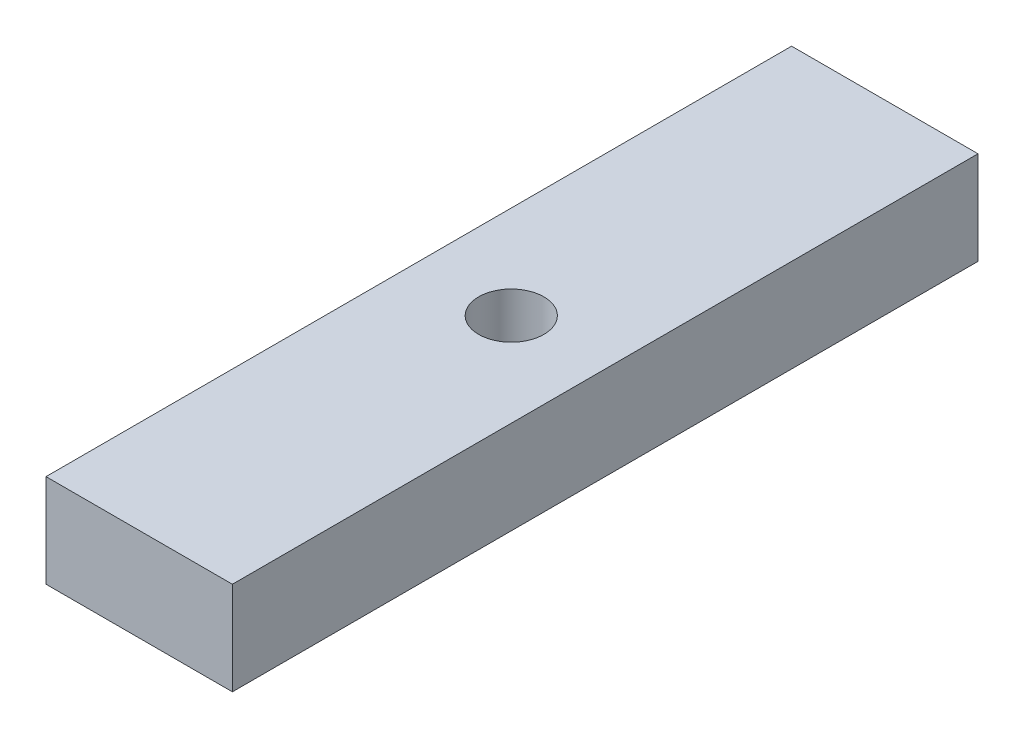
ISO-10303-21;
HEADER;
FILE_DESCRIPTION(('STEP AP214'),'2;1');
FILE_NAME('part.step','',(''),(''),'','','');
FILE_SCHEMA(('AUTOMOTIVE_DESIGN { 1 0 10303 214 1 1 1 1 }'));
ENDSEC;
DATA;
#1=APPLICATION_CONTEXT('core data for automotive mechanical design processes');
#2=APPLICATION_PROTOCOL_DEFINITION('international standard','automotive_design',2000,#1);
#3=PRODUCT_CONTEXT('',#1,'mechanical');
#4=PRODUCT('Part','Part','',(#3));
#5=PRODUCT_RELATED_PRODUCT_CATEGORY('part','',(#4));
#6=PRODUCT_DEFINITION_FORMATION('','',#4);
#7=PRODUCT_DEFINITION_CONTEXT('part definition',#1,'design');
#8=PRODUCT_DEFINITION('design','',#6,#7);
#9=PRODUCT_DEFINITION_SHAPE('','',#8);
#10=(LENGTH_UNIT() NAMED_UNIT(*) SI_UNIT(.MILLI.,.METRE.));
#11=(NAMED_UNIT(*) PLANE_ANGLE_UNIT() SI_UNIT($,.RADIAN.));
#12=(NAMED_UNIT(*) SI_UNIT($,.STERADIAN.) SOLID_ANGLE_UNIT());
#13=UNCERTAINTY_MEASURE_WITH_UNIT(LENGTH_MEASURE(1.E-05),#10,'distance_accuracy_value','');
#14=(GEOMETRIC_REPRESENTATION_CONTEXT(3) GLOBAL_UNCERTAINTY_ASSIGNED_CONTEXT((#13)) GLOBAL_UNIT_ASSIGNED_CONTEXT((#10,
#11,#12)) REPRESENTATION_CONTEXT('',''));
#15=CARTESIAN_POINT('',(0.,0.,0.));
#16=DIRECTION('',(0.,0.,1.));
#17=DIRECTION('',(1.,0.,0.));
#18=AXIS2_PLACEMENT_3D('',#15,#16,#17);
#19=CARTESIAN_POINT('',(0.,0.,-80.));
#20=DIRECTION('',(-1.,0.,0.));
#21=DIRECTION('',(0.,0.,1.));
#22=AXIS2_PLACEMENT_3D('',#19,#20,#21);
#23=PLANE('',#22);
#24=DIRECTION('',(0.,-1.,0.));
#25=VECTOR('',#24,1.);
#26=CARTESIAN_POINT('',(0.,0.,0.));
#27=LINE('',#26,#25);
#28=CARTESIAN_POINT('',(0.,10.,0.));
#29=VERTEX_POINT('',#28);
#30=CARTESIAN_POINT('',(0.,0.,0.));
#31=VERTEX_POINT('',#30);
#32=EDGE_CURVE('E67',#29,#31,#27,.T.);
#33=ORIENTED_EDGE('',*,*,#32,.F.);
#34=DIRECTION('',(0.,0.,1.));
#35=VECTOR('',#34,1.);
#36=CARTESIAN_POINT('',(0.,10.,-80.));
#37=LINE('',#36,#35);
#38=CARTESIAN_POINT('',(0.,10.,-80.));
#39=VERTEX_POINT('',#38);
#40=EDGE_CURVE('E11',#39,#29,#37,.T.);
#41=ORIENTED_EDGE('',*,*,#40,.F.);
#42=DIRECTION('',(0.,-1.,0.));
#43=VECTOR('',#42,1.);
#44=CARTESIAN_POINT('',(0.,0.,-80.));
#45=LINE('',#44,#43);
#46=CARTESIAN_POINT('',(0.,0.,-80.));
#47=VERTEX_POINT('',#46);
#48=EDGE_CURVE('E69',#39,#47,#45,.T.);
#49=ORIENTED_EDGE('',*,*,#48,.T.);
#50=DIRECTION('',(0.,0.,1.));
#51=VECTOR('',#50,1.);
#52=CARTESIAN_POINT('',(0.,0.,-80.));
#53=LINE('',#52,#51);
#54=EDGE_CURVE('E30',#47,#31,#53,.T.);
#55=ORIENTED_EDGE('',*,*,#54,.T.);
#56=EDGE_LOOP('',(#33,#41,#49,#55));
#57=FACE_BOUND('',#56,.T.);
#58=ADVANCED_FACE('F27',(#57),#23,.T.);
#59=CARTESIAN_POINT('',(0.,10.,-80.));
#60=DIRECTION('',(0.,1.,0.));
#61=DIRECTION('',(0.,0.,1.));
#62=AXIS2_PLACEMENT_3D('',#59,#60,#61);
#63=PLANE('',#62);
#64=CARTESIAN_POINT('',(10.,10.,-39.9221638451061));
#65=DIRECTION('',(0.,1.,0.));
#66=DIRECTION('',(0.,0.,1.));
#67=AXIS2_PLACEMENT_3D('',#64,#65,#66);
#68=CIRCLE('',#67,3.5);
#69=CARTESIAN_POINT('',(10.,10.,-36.4221638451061));
#70=VERTEX_POINT('',#69);
#71=EDGE_CURVE('E88',#70,#70,#68,.T.);
#72=ORIENTED_EDGE('',*,*,#71,.F.);
#73=EDGE_LOOP('',(#72));
#74=FACE_BOUND('',#73,.T.);
#75=DIRECTION('',(-1.,0.,0.));
#76=VECTOR('',#75,1.);
#77=CARTESIAN_POINT('',(0.,10.,0.));
#78=LINE('',#77,#76);
#79=CARTESIAN_POINT('',(20.,10.,0.));
#80=VERTEX_POINT('',#79);
#81=EDGE_CURVE('E84',#80,#29,#78,.T.);
#82=ORIENTED_EDGE('',*,*,#81,.F.);
#83=DIRECTION('',(0.,0.,1.));
#84=VECTOR('',#83,1.);
#85=CARTESIAN_POINT('',(20.,10.,-80.));
#86=LINE('',#85,#84);
#87=CARTESIAN_POINT('',(20.,10.,-80.));
#88=VERTEX_POINT('',#87);
#89=EDGE_CURVE('E35',#88,#80,#86,.T.);
#90=ORIENTED_EDGE('',*,*,#89,.F.);
#91=DIRECTION('',(-1.,0.,0.));
#92=VECTOR('',#91,1.);
#93=CARTESIAN_POINT('',(0.,10.,-80.));
#94=LINE('',#93,#92);
#95=EDGE_CURVE('E74',#88,#39,#94,.T.);
#96=ORIENTED_EDGE('',*,*,#95,.T.);
#97=ORIENTED_EDGE('',*,*,#40,.T.);
#98=EDGE_LOOP('',(#82,#90,#96,#97));
#99=FACE_BOUND('',#98,.T.);
#100=ADVANCED_FACE('F104',(#74,#99),#63,.T.);
#101=CARTESIAN_POINT('',(20.,0.,-80.));
#102=DIRECTION('',(1.,0.,0.));
#103=DIRECTION('',(0.,0.,-1.));
#104=AXIS2_PLACEMENT_3D('',#101,#102,#103);
#105=PLANE('',#104);
#106=DIRECTION('',(0.,1.,0.));
#107=VECTOR('',#106,1.);
#108=CARTESIAN_POINT('',(20.,0.,0.));
#109=LINE('',#108,#107);
#110=CARTESIAN_POINT('',(20.,0.,0.));
#111=VERTEX_POINT('',#110);
#112=EDGE_CURVE('E81',#111,#80,#109,.T.);
#113=ORIENTED_EDGE('',*,*,#112,.F.);
#114=DIRECTION('',(0.,0.,1.));
#115=VECTOR('',#114,1.);
#116=CARTESIAN_POINT('',(20.,0.,-80.));
#117=LINE('',#116,#115);
#118=CARTESIAN_POINT('',(20.,0.,-80.));
#119=VERTEX_POINT('',#118);
#120=EDGE_CURVE('E73',#119,#111,#117,.T.);
#121=ORIENTED_EDGE('',*,*,#120,.F.);
#122=DIRECTION('',(0.,1.,0.));
#123=VECTOR('',#122,1.);
#124=CARTESIAN_POINT('',(20.,0.,-80.));
#125=LINE('',#124,#123);
#126=EDGE_CURVE('E97',#119,#88,#125,.T.);
#127=ORIENTED_EDGE('',*,*,#126,.T.);
#128=ORIENTED_EDGE('',*,*,#89,.T.);
#129=EDGE_LOOP('',(#113,#121,#127,#128));
#130=FACE_BOUND('',#129,.T.);
#131=ADVANCED_FACE('F101',(#130),#105,.T.);
#132=CARTESIAN_POINT('',(0.,0.,-80.));
#133=DIRECTION('',(0.,-1.,0.));
#134=DIRECTION('',(0.,0.,-1.));
#135=AXIS2_PLACEMENT_3D('',#132,#133,#134);
#136=PLANE('',#135);
#137=CARTESIAN_POINT('',(10.,0.,-39.9221638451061));
#138=DIRECTION('',(0.,1.,0.));
#139=DIRECTION('',(0.,0.,1.));
#140=AXIS2_PLACEMENT_3D('',#137,#138,#139);
#141=CIRCLE('',#140,3.5);
#142=CARTESIAN_POINT('',(10.,0.,-36.4221638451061));
#143=VERTEX_POINT('',#142);
#144=EDGE_CURVE('E85',#143,#143,#141,.T.);
#145=ORIENTED_EDGE('',*,*,#144,.T.);
#146=EDGE_LOOP('',(#145));
#147=FACE_BOUND('',#146,.T.);
#148=DIRECTION('',(1.,0.,0.));
#149=VECTOR('',#148,1.);
#150=CARTESIAN_POINT('',(0.,0.,0.));
#151=LINE('',#150,#149);
#152=EDGE_CURVE('E76',#31,#111,#151,.T.);
#153=ORIENTED_EDGE('',*,*,#152,.F.);
#154=ORIENTED_EDGE('',*,*,#54,.F.);
#155=DIRECTION('',(1.,0.,0.));
#156=VECTOR('',#155,1.);
#157=CARTESIAN_POINT('',(0.,0.,-80.));
#158=LINE('',#157,#156);
#159=EDGE_CURVE('E95',#47,#119,#158,.T.);
#160=ORIENTED_EDGE('',*,*,#159,.T.);
#161=ORIENTED_EDGE('',*,*,#120,.T.);
#162=EDGE_LOOP('',(#153,#154,#160,#161));
#163=FACE_BOUND('',#162,.T.);
#164=ADVANCED_FACE('F77',(#147,#163),#136,.T.);
#165=CARTESIAN_POINT('',(0.,10.,-80.));
#166=DIRECTION('',(0.,0.,-1.));
#167=DIRECTION('',(-1.,0.,0.));
#168=AXIS2_PLACEMENT_3D('',#165,#166,#167);
#169=PLANE('',#168);
#170=ORIENTED_EDGE('',*,*,#48,.F.);
#171=ORIENTED_EDGE('',*,*,#95,.F.);
#172=ORIENTED_EDGE('',*,*,#126,.F.);
#173=ORIENTED_EDGE('',*,*,#159,.F.);
#174=EDGE_LOOP('',(#170,#171,#172,#173));
#175=FACE_BOUND('',#174,.T.);
#176=ADVANCED_FACE('F106',(#175),#169,.T.);
#177=CARTESIAN_POINT('',(0.,10.,0.));
#178=DIRECTION('',(0.,0.,-1.));
#179=DIRECTION('',(-1.,0.,0.));
#180=AXIS2_PLACEMENT_3D('',#177,#178,#179);
#181=PLANE('',#180);
#182=ORIENTED_EDGE('',*,*,#32,.T.);
#183=ORIENTED_EDGE('',*,*,#152,.T.);
#184=ORIENTED_EDGE('',*,*,#112,.T.);
#185=ORIENTED_EDGE('',*,*,#81,.T.);
#186=EDGE_LOOP('',(#182,#183,#184,#185));
#187=FACE_BOUND('',#186,.T.);
#188=ADVANCED_FACE('F83',(#187),#181,.F.);
#189=CARTESIAN_POINT('',(10.,0.,-39.9221638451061));
#190=DIRECTION('',(0.,1.,0.));
#191=DIRECTION('',(0.,0.,1.));
#192=AXIS2_PLACEMENT_3D('',#189,#190,#191);
#193=CYLINDRICAL_SURFACE('',#192,3.5);
#194=ORIENTED_EDGE('',*,*,#144,.F.);
#195=EDGE_LOOP('',(#194));
#196=FACE_BOUND('',#195,.T.);
#197=ORIENTED_EDGE('',*,*,#71,.T.);
#198=EDGE_LOOP('',(#197));
#199=FACE_BOUND('',#198,.T.);
#200=ADVANCED_FACE('F113',(#196,#199),#193,.F.);
#201=CLOSED_SHELL('',(#58,#100,#131,#164,#176,#188,#200));
#202=MANIFOLD_SOLID_BREP('B2',#201);
#203=ADVANCED_BREP_SHAPE_REPRESENTATION('',(#18,#202),#14);
#204=SHAPE_DEFINITION_REPRESENTATION(#9,#203);
ENDSEC;
END-ISO-10303-21;
